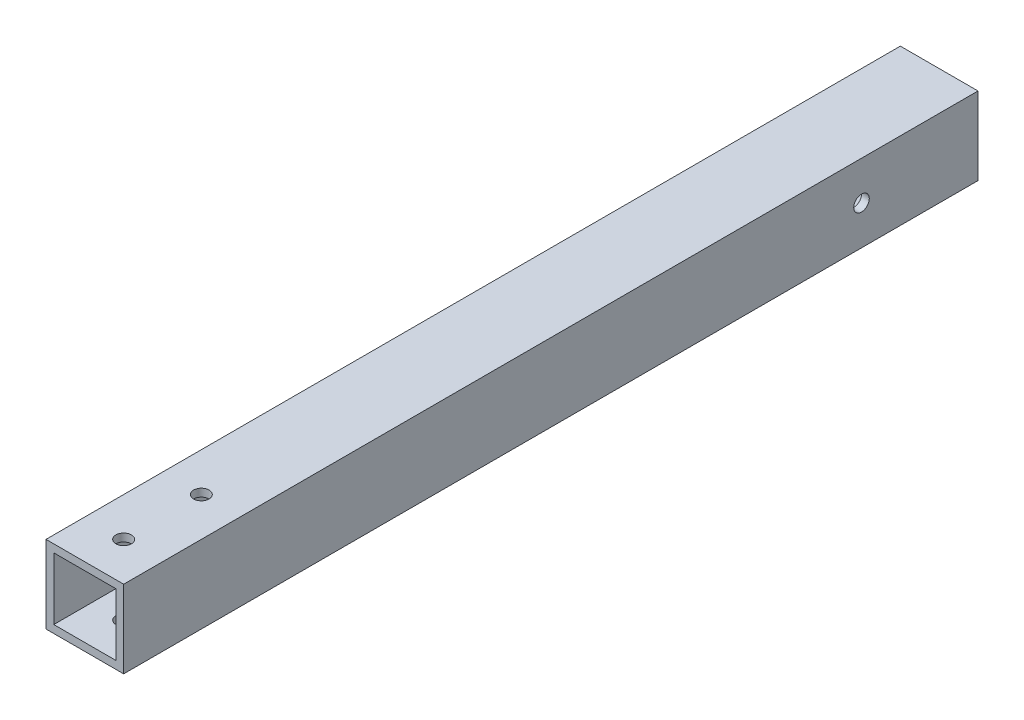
ISO-10303-21;
HEADER;
FILE_DESCRIPTION(('STEP AP214'),'2;1');
FILE_NAME('part.step','',(''),(''),'','','');
FILE_SCHEMA(('AUTOMOTIVE_DESIGN { 1 0 10303 214 1 1 1 1 }'));
ENDSEC;
DATA;
#1=APPLICATION_CONTEXT('core data for automotive mechanical design processes');
#2=APPLICATION_PROTOCOL_DEFINITION('international standard','automotive_design',2000,#1);
#3=PRODUCT_CONTEXT('',#1,'mechanical');
#4=PRODUCT('Part','Part','',(#3));
#5=PRODUCT_RELATED_PRODUCT_CATEGORY('part','',(#4));
#6=PRODUCT_DEFINITION_FORMATION('','',#4);
#7=PRODUCT_DEFINITION_CONTEXT('part definition',#1,'design');
#8=PRODUCT_DEFINITION('design','',#6,#7);
#9=PRODUCT_DEFINITION_SHAPE('','',#8);
#10=(LENGTH_UNIT() NAMED_UNIT(*) SI_UNIT(.MILLI.,.METRE.));
#11=(NAMED_UNIT(*) PLANE_ANGLE_UNIT() SI_UNIT($,.RADIAN.));
#12=(NAMED_UNIT(*) SI_UNIT($,.STERADIAN.) SOLID_ANGLE_UNIT());
#13=UNCERTAINTY_MEASURE_WITH_UNIT(LENGTH_MEASURE(1.E-05),#10,'distance_accuracy_value','');
#14=(GEOMETRIC_REPRESENTATION_CONTEXT(3) GLOBAL_UNCERTAINTY_ASSIGNED_CONTEXT((#13)) GLOBAL_UNIT_ASSIGNED_CONTEXT((#10,
#11,#12)) REPRESENTATION_CONTEXT('',''));
#15=CARTESIAN_POINT('',(0.,0.,0.));
#16=DIRECTION('',(0.,0.,1.));
#17=DIRECTION('',(1.,0.,0.));
#18=AXIS2_PLACEMENT_3D('',#15,#16,#17);
#19=CARTESIAN_POINT('',(0.,0.,220.));
#20=DIRECTION('',(0.,0.,1.));
#21=DIRECTION('',(1.,0.,0.));
#22=AXIS2_PLACEMENT_3D('',#19,#20,#21);
#23=PLANE('',#22);
#24=DIRECTION('',(0.,1.,0.));
#25=VECTOR('',#24,1.);
#26=CARTESIAN_POINT('',(10.,10.,220.));
#27=LINE('',#26,#25);
#28=CARTESIAN_POINT('',(10.,-10.,220.));
#29=VERTEX_POINT('',#28);
#30=CARTESIAN_POINT('',(10.,10.,220.));
#31=VERTEX_POINT('',#30);
#32=EDGE_CURVE('E140',#29,#31,#27,.T.);
#33=ORIENTED_EDGE('',*,*,#32,.T.);
#34=DIRECTION('',(-1.,0.,0.));
#35=VECTOR('',#34,1.);
#36=CARTESIAN_POINT('',(-10.,10.,220.));
#37=LINE('',#36,#35);
#38=CARTESIAN_POINT('',(-10.,10.,220.));
#39=VERTEX_POINT('',#38);
#40=EDGE_CURVE('E143',#31,#39,#37,.T.);
#41=ORIENTED_EDGE('',*,*,#40,.T.);
#42=DIRECTION('',(0.,-1.,0.));
#43=VECTOR('',#42,1.);
#44=CARTESIAN_POINT('',(-10.,10.,220.));
#45=LINE('',#44,#43);
#46=CARTESIAN_POINT('',(-9.99999999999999,-10.,220.));
#47=VERTEX_POINT('',#46);
#48=EDGE_CURVE('E146',#39,#47,#45,.T.);
#49=ORIENTED_EDGE('',*,*,#48,.T.);
#50=DIRECTION('',(1.,0.,0.));
#51=VECTOR('',#50,1.);
#52=CARTESIAN_POINT('',(-9.99999999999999,-10.,220.));
#53=LINE('',#52,#51);
#54=EDGE_CURVE('E148',#47,#29,#53,.T.);
#55=ORIENTED_EDGE('',*,*,#54,.T.);
#56=EDGE_LOOP('',(#33,#41,#49,#55));
#57=FACE_BOUND('',#56,.T.);
#58=DIRECTION('',(1.,0.,0.));
#59=VECTOR('',#58,1.);
#60=CARTESIAN_POINT('',(-8.,-8.,220.));
#61=LINE('',#60,#59);
#62=CARTESIAN_POINT('',(-8.,-8.,220.));
#63=VERTEX_POINT('',#62);
#64=CARTESIAN_POINT('',(8.,-8.,220.));
#65=VERTEX_POINT('',#64);
#66=EDGE_CURVE('E110',#63,#65,#61,.T.);
#67=ORIENTED_EDGE('',*,*,#66,.F.);
#68=DIRECTION('',(0.,-1.,0.));
#69=VECTOR('',#68,1.);
#70=CARTESIAN_POINT('',(-8.,8.,220.));
#71=LINE('',#70,#69);
#72=CARTESIAN_POINT('',(-8.,8.,220.));
#73=VERTEX_POINT('',#72);
#74=EDGE_CURVE('E102',#73,#63,#71,.T.);
#75=ORIENTED_EDGE('',*,*,#74,.F.);
#76=DIRECTION('',(-1.,0.,0.));
#77=VECTOR('',#76,1.);
#78=CARTESIAN_POINT('',(-8.,8.,220.));
#79=LINE('',#78,#77);
#80=CARTESIAN_POINT('',(8.,8.,220.));
#81=VERTEX_POINT('',#80);
#82=EDGE_CURVE('E124',#81,#73,#79,.T.);
#83=ORIENTED_EDGE('',*,*,#82,.F.);
#84=DIRECTION('',(0.,1.,0.));
#85=VECTOR('',#84,1.);
#86=CARTESIAN_POINT('',(8.,8.,220.));
#87=LINE('',#86,#85);
#88=EDGE_CURVE('E122',#65,#81,#87,.T.);
#89=ORIENTED_EDGE('',*,*,#88,.F.);
#90=EDGE_LOOP('',(#67,#75,#83,#89));
#91=FACE_BOUND('',#90,.T.);
#92=ADVANCED_FACE('F35',(#57,#91),#23,.T.);
#93=CARTESIAN_POINT('',(0.,0.,0.));
#94=DIRECTION('',(0.,0.,1.));
#95=DIRECTION('',(1.,0.,0.));
#96=AXIS2_PLACEMENT_3D('',#93,#94,#95);
#97=PLANE('',#96);
#98=DIRECTION('',(0.,1.,0.));
#99=VECTOR('',#98,1.);
#100=CARTESIAN_POINT('',(10.,10.,0.));
#101=LINE('',#100,#99);
#102=CARTESIAN_POINT('',(10.,-10.,0.));
#103=VERTEX_POINT('',#102);
#104=CARTESIAN_POINT('',(10.,10.,0.));
#105=VERTEX_POINT('',#104);
#106=EDGE_CURVE('E118',#103,#105,#101,.T.);
#107=ORIENTED_EDGE('',*,*,#106,.F.);
#108=DIRECTION('',(1.,0.,0.));
#109=VECTOR('',#108,1.);
#110=CARTESIAN_POINT('',(-9.99999999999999,-10.,0.));
#111=LINE('',#110,#109);
#112=CARTESIAN_POINT('',(-9.99999999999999,-10.,0.));
#113=VERTEX_POINT('',#112);
#114=EDGE_CURVE('E144',#113,#103,#111,.T.);
#115=ORIENTED_EDGE('',*,*,#114,.F.);
#116=DIRECTION('',(0.,-1.,0.));
#117=VECTOR('',#116,1.);
#118=CARTESIAN_POINT('',(-10.,10.,0.));
#119=LINE('',#118,#117);
#120=CARTESIAN_POINT('',(-10.,10.,0.));
#121=VERTEX_POINT('',#120);
#122=EDGE_CURVE('E155',#121,#113,#119,.T.);
#123=ORIENTED_EDGE('',*,*,#122,.F.);
#124=DIRECTION('',(-1.,0.,0.));
#125=VECTOR('',#124,1.);
#126=CARTESIAN_POINT('',(-10.,10.,0.));
#127=LINE('',#126,#125);
#128=EDGE_CURVE('E153',#105,#121,#127,.T.);
#129=ORIENTED_EDGE('',*,*,#128,.F.);
#130=EDGE_LOOP('',(#107,#115,#123,#129));
#131=FACE_BOUND('',#130,.T.);
#132=DIRECTION('',(0.,-1.,0.));
#133=VECTOR('',#132,1.);
#134=CARTESIAN_POINT('',(-8.,8.,0.));
#135=LINE('',#134,#133);
#136=CARTESIAN_POINT('',(-8.,8.,0.));
#137=VERTEX_POINT('',#136);
#138=CARTESIAN_POINT('',(-8.,-8.,0.));
#139=VERTEX_POINT('',#138);
#140=EDGE_CURVE('E60',#137,#139,#135,.T.);
#141=ORIENTED_EDGE('',*,*,#140,.T.);
#142=DIRECTION('',(1.,0.,0.));
#143=VECTOR('',#142,1.);
#144=CARTESIAN_POINT('',(-8.,-8.,0.));
#145=LINE('',#144,#143);
#146=CARTESIAN_POINT('',(8.,-8.,0.));
#147=VERTEX_POINT('',#146);
#148=EDGE_CURVE('E117',#139,#147,#145,.T.);
#149=ORIENTED_EDGE('',*,*,#148,.T.);
#150=DIRECTION('',(0.,1.,0.));
#151=VECTOR('',#150,1.);
#152=CARTESIAN_POINT('',(8.,8.,0.));
#153=LINE('',#152,#151);
#154=CARTESIAN_POINT('',(8.,8.,0.));
#155=VERTEX_POINT('',#154);
#156=EDGE_CURVE('E132',#147,#155,#153,.T.);
#157=ORIENTED_EDGE('',*,*,#156,.T.);
#158=DIRECTION('',(-1.,0.,0.));
#159=VECTOR('',#158,1.);
#160=CARTESIAN_POINT('',(-8.,8.,0.));
#161=LINE('',#160,#159);
#162=EDGE_CURVE('E111',#155,#137,#161,.T.);
#163=ORIENTED_EDGE('',*,*,#162,.T.);
#164=EDGE_LOOP('',(#141,#149,#157,#163));
#165=FACE_BOUND('',#164,.T.);
#166=ADVANCED_FACE('F212',(#131,#165),#97,.F.);
#167=CARTESIAN_POINT('',(10.,10.,220.));
#168=DIRECTION('',(-1.,0.,0.));
#169=DIRECTION('',(0.,-1.,0.));
#170=AXIS2_PLACEMENT_3D('',#167,#168,#169);
#171=PLANE('',#170);
#172=CARTESIAN_POINT('',(10.,0.,30.0000000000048));
#173=DIRECTION('',(-1.,0.,0.));
#174=DIRECTION('',(0.,0.,1.));
#175=AXIS2_PLACEMENT_3D('',#172,#173,#174);
#176=CIRCLE('',#175,2.);
#177=CARTESIAN_POINT('',(10.,0.,32.0000000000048));
#178=VERTEX_POINT('',#177);
#179=EDGE_CURVE('E282',#178,#178,#176,.T.);
#180=ORIENTED_EDGE('',*,*,#179,.T.);
#181=EDGE_LOOP('',(#180));
#182=FACE_BOUND('',#181,.T.);
#183=ORIENTED_EDGE('',*,*,#106,.T.);
#184=DIRECTION('',(0.,0.,-1.));
#185=VECTOR('',#184,1.);
#186=CARTESIAN_POINT('',(10.,10.,220.));
#187=LINE('',#186,#185);
#188=EDGE_CURVE('E11',#31,#105,#187,.T.);
#189=ORIENTED_EDGE('',*,*,#188,.F.);
#190=ORIENTED_EDGE('',*,*,#32,.F.);
#191=DIRECTION('',(0.,0.,-1.));
#192=VECTOR('',#191,1.);
#193=CARTESIAN_POINT('',(10.,-10.,220.));
#194=LINE('',#193,#192);
#195=EDGE_CURVE('E150',#29,#103,#194,.T.);
#196=ORIENTED_EDGE('',*,*,#195,.T.);
#197=EDGE_LOOP('',(#183,#189,#190,#196));
#198=FACE_BOUND('',#197,.T.);
#199=ADVANCED_FACE('F37',(#182,#198),#171,.F.);
#200=CARTESIAN_POINT('',(-10.,10.,220.));
#201=DIRECTION('',(0.,-1.,0.));
#202=DIRECTION('',(0.,0.,-1.));
#203=AXIS2_PLACEMENT_3D('',#200,#201,#202);
#204=PLANE('',#203);
#205=CARTESIAN_POINT('',(1.23616394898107E-11,10.,210.000000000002));
#206=DIRECTION('',(0.,1.,0.));
#207=DIRECTION('',(0.,0.,1.));
#208=AXIS2_PLACEMENT_3D('',#205,#206,#207);
#209=CIRCLE('',#208,1.99999999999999);
#210=CARTESIAN_POINT('',(1.23616394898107E-11,10.,212.000000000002));
#211=VERTEX_POINT('',#210);
#212=EDGE_CURVE('E178',#211,#211,#209,.T.);
#213=ORIENTED_EDGE('',*,*,#212,.F.);
#214=EDGE_LOOP('',(#213));
#215=FACE_BOUND('',#214,.T.);
#216=CARTESIAN_POINT('',(1.23616394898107E-11,10.,190.000000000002));
#217=DIRECTION('',(0.,1.,0.));
#218=DIRECTION('',(0.,0.,1.));
#219=AXIS2_PLACEMENT_3D('',#216,#217,#218);
#220=CIRCLE('',#219,1.99999999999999);
#221=CARTESIAN_POINT('',(1.23616394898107E-11,10.,192.000000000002));
#222=VERTEX_POINT('',#221);
#223=EDGE_CURVE('E175',#222,#222,#220,.T.);
#224=ORIENTED_EDGE('',*,*,#223,.F.);
#225=EDGE_LOOP('',(#224));
#226=FACE_BOUND('',#225,.T.);
#227=ORIENTED_EDGE('',*,*,#128,.T.);
#228=DIRECTION('',(0.,0.,-1.));
#229=VECTOR('',#228,1.);
#230=CARTESIAN_POINT('',(-10.,10.,220.));
#231=LINE('',#230,#229);
#232=EDGE_CURVE('E44',#39,#121,#231,.T.);
#233=ORIENTED_EDGE('',*,*,#232,.F.);
#234=ORIENTED_EDGE('',*,*,#40,.F.);
#235=ORIENTED_EDGE('',*,*,#188,.T.);
#236=EDGE_LOOP('',(#227,#233,#234,#235));
#237=FACE_BOUND('',#236,.T.);
#238=ADVANCED_FACE('F225',(#215,#226,#237),#204,.F.);
#239=CARTESIAN_POINT('',(-10.,10.,220.));
#240=DIRECTION('',(1.,0.,0.));
#241=DIRECTION('',(0.,1.,0.));
#242=AXIS2_PLACEMENT_3D('',#239,#240,#241);
#243=PLANE('',#242);
#244=CARTESIAN_POINT('',(-10.,0.,30.0000000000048));
#245=DIRECTION('',(-1.,0.,0.));
#246=DIRECTION('',(0.,0.,1.));
#247=AXIS2_PLACEMENT_3D('',#244,#245,#246);
#248=CIRCLE('',#247,1.99999999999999);
#249=CARTESIAN_POINT('',(-10.,0.,32.0000000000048));
#250=VERTEX_POINT('',#249);
#251=EDGE_CURVE('E283',#250,#250,#248,.T.);
#252=ORIENTED_EDGE('',*,*,#251,.F.);
#253=EDGE_LOOP('',(#252));
#254=FACE_BOUND('',#253,.T.);
#255=ORIENTED_EDGE('',*,*,#122,.T.);
#256=DIRECTION('',(0.,0.,-1.));
#257=VECTOR('',#256,1.);
#258=CARTESIAN_POINT('',(-9.99999999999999,-10.,220.));
#259=LINE('',#258,#257);
#260=EDGE_CURVE('E160',#47,#113,#259,.T.);
#261=ORIENTED_EDGE('',*,*,#260,.F.);
#262=ORIENTED_EDGE('',*,*,#48,.F.);
#263=ORIENTED_EDGE('',*,*,#232,.T.);
#264=EDGE_LOOP('',(#255,#261,#262,#263));
#265=FACE_BOUND('',#264,.T.);
#266=ADVANCED_FACE('F223',(#254,#265),#243,.F.);
#267=CARTESIAN_POINT('',(-9.99999999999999,-10.,220.));
#268=DIRECTION('',(0.,1.,0.));
#269=DIRECTION('',(0.,0.,1.));
#270=AXIS2_PLACEMENT_3D('',#267,#268,#269);
#271=PLANE('',#270);
#272=CARTESIAN_POINT('',(1.23616394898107E-11,-10.,210.000000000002));
#273=DIRECTION('',(0.,1.,0.));
#274=DIRECTION('',(0.,0.,1.));
#275=AXIS2_PLACEMENT_3D('',#272,#273,#274);
#276=CIRCLE('',#275,2.);
#277=CARTESIAN_POINT('',(1.23616394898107E-11,-10.,212.000000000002));
#278=VERTEX_POINT('',#277);
#279=EDGE_CURVE('E171',#278,#278,#276,.T.);
#280=ORIENTED_EDGE('',*,*,#279,.T.);
#281=EDGE_LOOP('',(#280));
#282=FACE_BOUND('',#281,.T.);
#283=CARTESIAN_POINT('',(1.23616394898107E-11,-10.,190.000000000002));
#284=DIRECTION('',(0.,1.,0.));
#285=DIRECTION('',(0.,0.,1.));
#286=AXIS2_PLACEMENT_3D('',#283,#284,#285);
#287=CIRCLE('',#286,2.);
#288=CARTESIAN_POINT('',(1.23616394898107E-11,-10.,192.000000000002));
#289=VERTEX_POINT('',#288);
#290=EDGE_CURVE('E167',#289,#289,#287,.T.);
#291=ORIENTED_EDGE('',*,*,#290,.T.);
#292=EDGE_LOOP('',(#291));
#293=FACE_BOUND('',#292,.T.);
#294=ORIENTED_EDGE('',*,*,#114,.T.);
#295=ORIENTED_EDGE('',*,*,#195,.F.);
#296=ORIENTED_EDGE('',*,*,#54,.F.);
#297=ORIENTED_EDGE('',*,*,#260,.T.);
#298=EDGE_LOOP('',(#294,#295,#296,#297));
#299=FACE_BOUND('',#298,.T.);
#300=ADVANCED_FACE('F207',(#282,#293,#299),#271,.F.);
#301=CARTESIAN_POINT('',(-8.,8.,220.));
#302=DIRECTION('',(1.,0.,0.));
#303=DIRECTION('',(0.,0.,-1.));
#304=AXIS2_PLACEMENT_3D('',#301,#302,#303);
#305=PLANE('',#304);
#306=CARTESIAN_POINT('',(-8.,0.,30.0000000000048));
#307=DIRECTION('',(1.,0.,0.));
#308=DIRECTION('',(0.,0.,-1.));
#309=AXIS2_PLACEMENT_3D('',#306,#307,#308);
#310=CIRCLE('',#309,1.99999999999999);
#311=CARTESIAN_POINT('',(-8.,0.,28.0000000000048));
#312=VERTEX_POINT('',#311);
#313=EDGE_CURVE('E183',#312,#312,#310,.T.);
#314=ORIENTED_EDGE('',*,*,#313,.F.);
#315=EDGE_LOOP('',(#314));
#316=FACE_BOUND('',#315,.T.);
#317=ORIENTED_EDGE('',*,*,#140,.F.);
#318=DIRECTION('',(0.,0.,-1.));
#319=VECTOR('',#318,1.);
#320=CARTESIAN_POINT('',(-8.,8.,220.));
#321=LINE('',#320,#319);
#322=EDGE_CURVE('E106',#73,#137,#321,.T.);
#323=ORIENTED_EDGE('',*,*,#322,.F.);
#324=ORIENTED_EDGE('',*,*,#74,.T.);
#325=DIRECTION('',(0.,0.,-1.));
#326=VECTOR('',#325,1.);
#327=CARTESIAN_POINT('',(-8.,-8.,220.));
#328=LINE('',#327,#326);
#329=EDGE_CURVE('E105',#63,#139,#328,.T.);
#330=ORIENTED_EDGE('',*,*,#329,.T.);
#331=EDGE_LOOP('',(#317,#323,#324,#330));
#332=FACE_BOUND('',#331,.T.);
#333=ADVANCED_FACE('F104',(#316,#332),#305,.T.);
#334=CARTESIAN_POINT('',(-8.,-8.,220.));
#335=DIRECTION('',(0.,1.,0.));
#336=DIRECTION('',(-1.,0.,0.));
#337=AXIS2_PLACEMENT_3D('',#334,#335,#336);
#338=PLANE('',#337);
#339=CARTESIAN_POINT('',(1.23616394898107E-11,-8.,210.000000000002));
#340=DIRECTION('',(0.,1.,0.));
#341=DIRECTION('',(-1.,0.,0.));
#342=AXIS2_PLACEMENT_3D('',#339,#340,#341);
#343=CIRCLE('',#342,1.99999999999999);
#344=CARTESIAN_POINT('',(-1.99999999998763,-8.,210.000000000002));
#345=VERTEX_POINT('',#344);
#346=EDGE_CURVE('E170',#345,#345,#343,.T.);
#347=ORIENTED_EDGE('',*,*,#346,.F.);
#348=EDGE_LOOP('',(#347));
#349=FACE_BOUND('',#348,.T.);
#350=CARTESIAN_POINT('',(1.23616394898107E-11,-8.,190.000000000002));
#351=DIRECTION('',(0.,1.,0.));
#352=DIRECTION('',(-1.,0.,0.));
#353=AXIS2_PLACEMENT_3D('',#350,#351,#352);
#354=CIRCLE('',#353,1.99999999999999);
#355=CARTESIAN_POINT('',(-1.99999999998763,-8.,190.000000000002));
#356=VERTEX_POINT('',#355);
#357=EDGE_CURVE('E130',#356,#356,#354,.T.);
#358=ORIENTED_EDGE('',*,*,#357,.F.);
#359=EDGE_LOOP('',(#358));
#360=FACE_BOUND('',#359,.T.);
#361=ORIENTED_EDGE('',*,*,#148,.F.);
#362=ORIENTED_EDGE('',*,*,#329,.F.);
#363=ORIENTED_EDGE('',*,*,#66,.T.);
#364=DIRECTION('',(0.,0.,-1.));
#365=VECTOR('',#364,1.);
#366=CARTESIAN_POINT('',(8.,-8.,220.));
#367=LINE('',#366,#365);
#368=EDGE_CURVE('E119',#65,#147,#367,.T.);
#369=ORIENTED_EDGE('',*,*,#368,.T.);
#370=EDGE_LOOP('',(#361,#362,#363,#369));
#371=FACE_BOUND('',#370,.T.);
#372=ADVANCED_FACE('F114',(#349,#360,#371),#338,.T.);
#373=CARTESIAN_POINT('',(8.,8.,220.));
#374=DIRECTION('',(-1.,0.,0.));
#375=DIRECTION('',(0.,0.,1.));
#376=AXIS2_PLACEMENT_3D('',#373,#374,#375);
#377=PLANE('',#376);
#378=CARTESIAN_POINT('',(8.,0.,30.0000000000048));
#379=DIRECTION('',(-1.,0.,0.));
#380=DIRECTION('',(0.,0.,1.));
#381=AXIS2_PLACEMENT_3D('',#378,#379,#380);
#382=CIRCLE('',#381,1.99999999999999);
#383=CARTESIAN_POINT('',(8.,0.,32.0000000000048));
#384=VERTEX_POINT('',#383);
#385=EDGE_CURVE('E39',#384,#384,#382,.T.);
#386=ORIENTED_EDGE('',*,*,#385,.F.);
#387=EDGE_LOOP('',(#386));
#388=FACE_BOUND('',#387,.T.);
#389=ORIENTED_EDGE('',*,*,#156,.F.);
#390=ORIENTED_EDGE('',*,*,#368,.F.);
#391=ORIENTED_EDGE('',*,*,#88,.T.);
#392=DIRECTION('',(0.,0.,-1.));
#393=VECTOR('',#392,1.);
#394=CARTESIAN_POINT('',(8.,8.,220.));
#395=LINE('',#394,#393);
#396=EDGE_CURVE('E52',#81,#155,#395,.T.);
#397=ORIENTED_EDGE('',*,*,#396,.T.);
#398=EDGE_LOOP('',(#389,#390,#391,#397));
#399=FACE_BOUND('',#398,.T.);
#400=ADVANCED_FACE('F197',(#388,#399),#377,.T.);
#401=CARTESIAN_POINT('',(-8.,8.,220.));
#402=DIRECTION('',(0.,-1.,0.));
#403=DIRECTION('',(0.,0.,-1.));
#404=AXIS2_PLACEMENT_3D('',#401,#402,#403);
#405=PLANE('',#404);
#406=CARTESIAN_POINT('',(1.23616394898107E-11,8.,210.000000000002));
#407=DIRECTION('',(0.,-1.,0.));
#408=DIRECTION('',(0.,0.,-1.));
#409=AXIS2_PLACEMENT_3D('',#406,#407,#408);
#410=CIRCLE('',#409,1.99999999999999);
#411=CARTESIAN_POINT('',(1.23616394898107E-11,8.,208.000000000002));
#412=VERTEX_POINT('',#411);
#413=EDGE_CURVE('E168',#412,#412,#410,.T.);
#414=ORIENTED_EDGE('',*,*,#413,.F.);
#415=EDGE_LOOP('',(#414));
#416=FACE_BOUND('',#415,.T.);
#417=CARTESIAN_POINT('',(1.23616394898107E-11,8.,190.000000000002));
#418=DIRECTION('',(0.,-1.,0.));
#419=DIRECTION('',(0.,0.,-1.));
#420=AXIS2_PLACEMENT_3D('',#417,#418,#419);
#421=CIRCLE('',#420,1.99999999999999);
#422=CARTESIAN_POINT('',(1.23616394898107E-11,8.,188.000000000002));
#423=VERTEX_POINT('',#422);
#424=EDGE_CURVE('E165',#423,#423,#421,.T.);
#425=ORIENTED_EDGE('',*,*,#424,.F.);
#426=EDGE_LOOP('',(#425));
#427=FACE_BOUND('',#426,.T.);
#428=ORIENTED_EDGE('',*,*,#162,.F.);
#429=ORIENTED_EDGE('',*,*,#396,.F.);
#430=ORIENTED_EDGE('',*,*,#82,.T.);
#431=ORIENTED_EDGE('',*,*,#322,.T.);
#432=EDGE_LOOP('',(#428,#429,#430,#431));
#433=FACE_BOUND('',#432,.T.);
#434=ADVANCED_FACE('F204',(#416,#427,#433),#405,.T.);
#435=CARTESIAN_POINT('',(1.23616394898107E-11,10.,190.000000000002));
#436=DIRECTION('',(0.,1.,0.));
#437=DIRECTION('',(0.,0.,1.));
#438=AXIS2_PLACEMENT_3D('',#435,#436,#437);
#439=CYLINDRICAL_SURFACE('',#438,1.99999999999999);
#440=ORIENTED_EDGE('',*,*,#424,.T.);
#441=EDGE_LOOP('',(#440));
#442=FACE_BOUND('',#441,.T.);
#443=ORIENTED_EDGE('',*,*,#223,.T.);
#444=EDGE_LOOP('',(#443));
#445=FACE_BOUND('',#444,.T.);
#446=ADVANCED_FACE('F253',(#442,#445),#439,.F.);
#447=ORIENTED_EDGE('',*,*,#357,.T.);
#448=EDGE_LOOP('',(#447));
#449=FACE_BOUND('',#448,.T.);
#450=ORIENTED_EDGE('',*,*,#290,.F.);
#451=EDGE_LOOP('',(#450));
#452=FACE_BOUND('',#451,.T.);
#453=ADVANCED_FACE('F193',(#449,#452),#439,.F.);
#454=CARTESIAN_POINT('',(1.23616394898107E-11,10.,210.000000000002));
#455=DIRECTION('',(0.,1.,0.));
#456=DIRECTION('',(0.,0.,1.));
#457=AXIS2_PLACEMENT_3D('',#454,#455,#456);
#458=CYLINDRICAL_SURFACE('',#457,1.99999999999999);
#459=ORIENTED_EDGE('',*,*,#413,.T.);
#460=EDGE_LOOP('',(#459));
#461=FACE_BOUND('',#460,.T.);
#462=ORIENTED_EDGE('',*,*,#212,.T.);
#463=EDGE_LOOP('',(#462));
#464=FACE_BOUND('',#463,.T.);
#465=ADVANCED_FACE('F263',(#461,#464),#458,.F.);
#466=ORIENTED_EDGE('',*,*,#346,.T.);
#467=EDGE_LOOP('',(#466));
#468=FACE_BOUND('',#467,.T.);
#469=ORIENTED_EDGE('',*,*,#279,.F.);
#470=EDGE_LOOP('',(#469));
#471=FACE_BOUND('',#470,.T.);
#472=ADVANCED_FACE('F266',(#468,#471),#458,.F.);
#473=CARTESIAN_POINT('',(-9.99999999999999,0.,30.0000000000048));
#474=DIRECTION('',(-1.,0.,0.));
#475=DIRECTION('',(0.,0.,1.));
#476=AXIS2_PLACEMENT_3D('',#473,#474,#475);
#477=CYLINDRICAL_SURFACE('',#476,1.99999999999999);
#478=ORIENTED_EDGE('',*,*,#385,.T.);
#479=EDGE_LOOP('',(#478));
#480=FACE_BOUND('',#479,.T.);
#481=ORIENTED_EDGE('',*,*,#179,.F.);
#482=EDGE_LOOP('',(#481));
#483=FACE_BOUND('',#482,.T.);
#484=ADVANCED_FACE('F267',(#480,#483),#477,.F.);
#485=ORIENTED_EDGE('',*,*,#313,.T.);
#486=EDGE_LOOP('',(#485));
#487=FACE_BOUND('',#486,.T.);
#488=ORIENTED_EDGE('',*,*,#251,.T.);
#489=EDGE_LOOP('',(#488));
#490=FACE_BOUND('',#489,.T.);
#491=ADVANCED_FACE('F269',(#487,#490),#477,.F.);
#492=CLOSED_SHELL('',(#92,#166,#199,#238,#266,#300,#333,#372,#400,#434,#446,#453,#465,#472,#484,#491));
#493=MANIFOLD_SOLID_BREP('B2',#492);
#494=ADVANCED_BREP_SHAPE_REPRESENTATION('',(#18,#493),#14);
#495=SHAPE_DEFINITION_REPRESENTATION(#9,#494);
ENDSEC;
END-ISO-10303-21;
